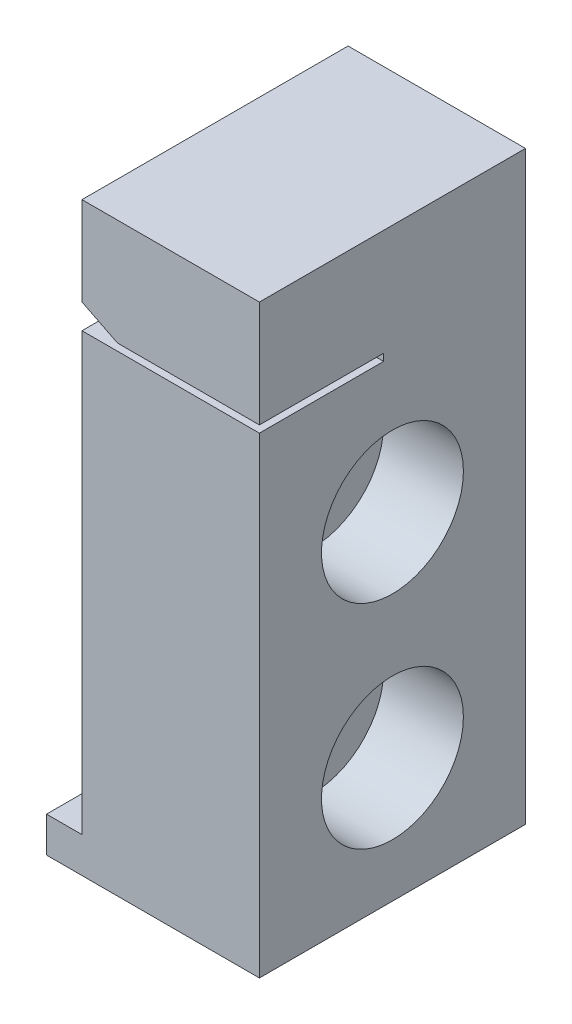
from build123d import *

# Parameters (mm, degrees)
EXTRUDE_1_DEPTH     = 15
SKETCH_2_OUTSIDE_W  = 24.636
SKETCH_2_OUTSIDE_H  = 42.636
SKETCH_2_OUTSIDE_R  = 2.25
CUT_EXTRUDE_1_DEPTH = 39.183766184
SKETCH_3_R          = 4
CUT_EXTRUDE_2_DEPTH = 4.5
CUT_EXTRUDE_3_DEPTH = 7


with BuildPart() as part:
    # Sketch 1 → Extrude 1 (new body)
    with BuildSketch(Plane.XY):
        Polygon((2, 2), (2, 33), (12, 33), (12, 0), (0, 0), (0, 2), align=None)
    extrude(amount=EXTRUDE_1_DEPTH)

    # Sketch 2 outside → Cut-Extrude 1 (cut, through all)
    # profile 1 of 3: a face of its own
    with BuildSketch(Plane(origin=(12, 0, 0), x_dir=(0, 0, -1), z_dir=(1, 0, 0))):
        with Locations((-7.5, 16.5)):
            Rectangle(SKETCH_2_OUTSIDE_W, SKETCH_2_OUTSIDE_H)
        Polygon((0, 0), (0, 33), (-15, 33), (-15, 27), (-8, 27), (-8, 26.6), (-15, 26.6), (-15, 0), align=None, mode=Mode.SUBTRACT)
    # profile 2 of 3: a face of its own
    with BuildSketch(Plane(origin=(12, 0, 0), x_dir=(0, 0, -1), z_dir=(1, 0, 0))):
        with Locations((-7.5, 7)):
            Circle(SKETCH_2_OUTSIDE_R)
    # profile 3 of 3: a face of its own
    with BuildSketch(Plane(origin=(12, 0, 0), x_dir=(0, 0, -1), z_dir=(1, 0, 0))):
        with Locations((-7.5, 19)):
            Circle(SKETCH_2_OUTSIDE_R)
    extrude(amount=-CUT_EXTRUDE_1_DEPTH, mode=Mode.SUBTRACT)

    # Sketch 3 → Cut-Extrude 2 (cut)
    with BuildSketch(Plane(origin=(12, 0, 0), x_dir=(0, 0, -1), z_dir=(1, 0, 0))):
        with Locations((-7.5, 7)):
            Circle(SKETCH_3_R)
        with Locations((-7.5, 19)):
            Circle(SKETCH_3_R)
    extrude(amount=-CUT_EXTRUDE_2_DEPTH, mode=Mode.SUBTRACT)

    # Sketch 4 → Cut-Extrude 3 (cut)
    with BuildSketch(Plane.XY.offset(15)):
        Polygon((2, 28), (4, 27), (2, 27), align=None)
    extrude(amount=-CUT_EXTRUDE_3_DEPTH, mode=Mode.SUBTRACT)


solid = part.part
